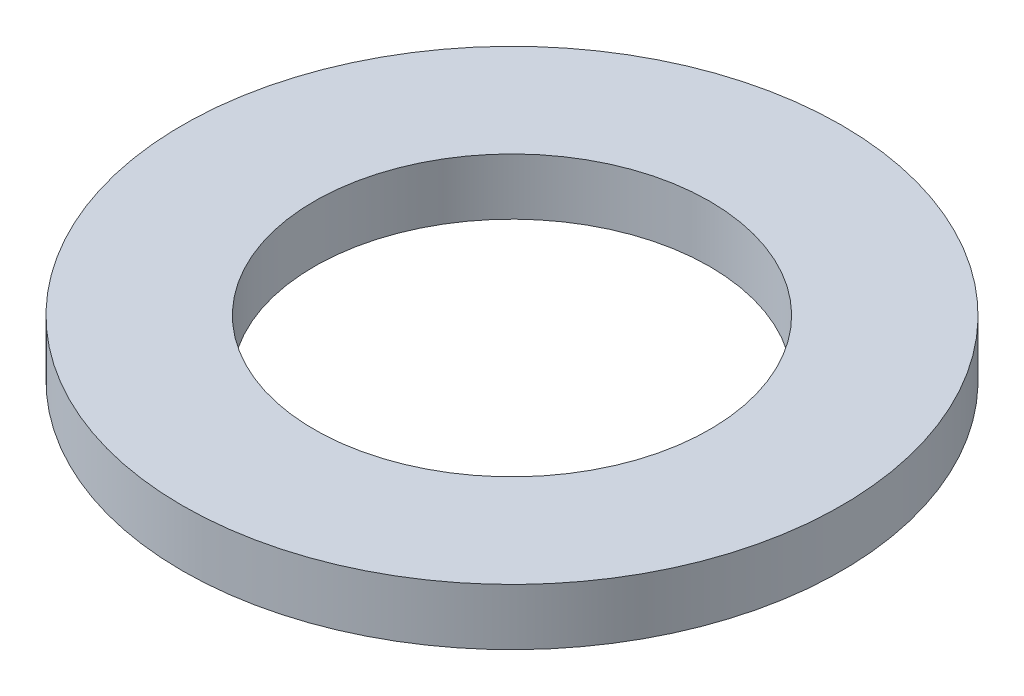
from build123d import *

# Parameters (mm, degrees)
ESQUISSE1_W = 2.8
ESQUISSE1_H = 1.2


with BuildPart() as part:
    # Esquisse1 → Base (revolve)
    with BuildSketch(Plane.XY, mode=Mode.PRIVATE) as base_sk:
        with Locations((5.6, 0.6)):
            Rectangle(ESQUISSE1_W, ESQUISSE1_H)
    revolve(base_sk.sketch.rotate(Axis((0, 0, 0), (0, 1, 0)), 90), axis=Axis((0, 0, 0), (0, 1, 0)))


solid = part.part
